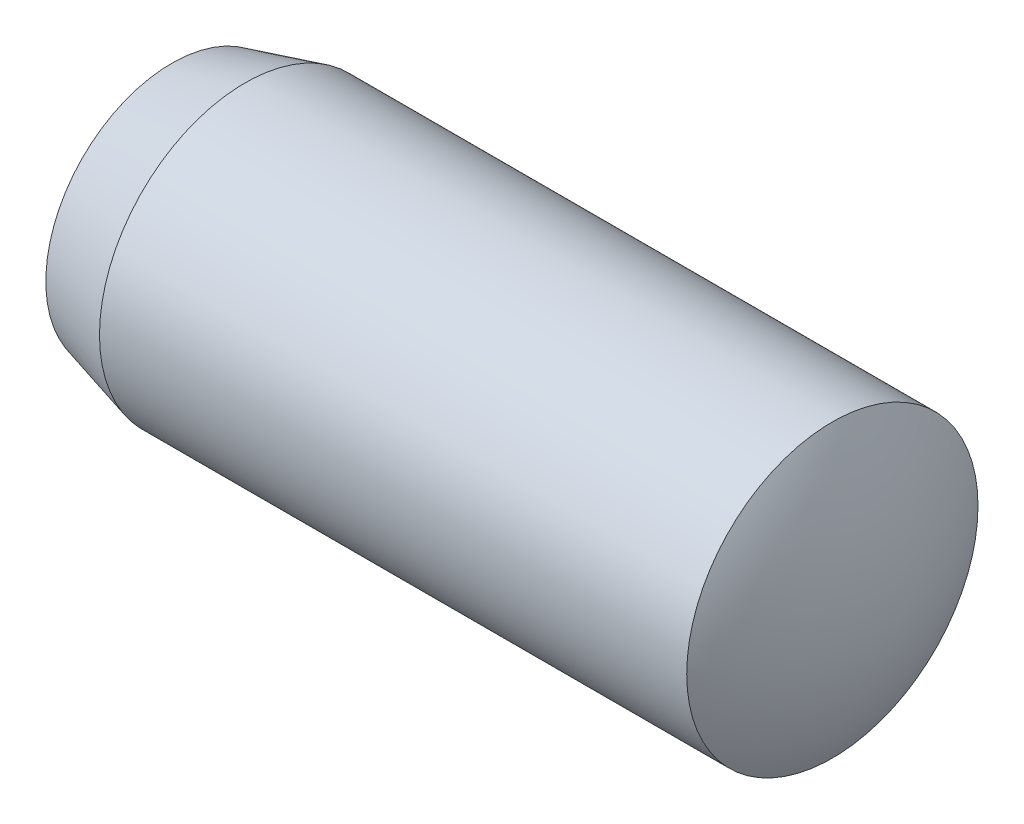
ISO-10303-21;
HEADER;
FILE_DESCRIPTION(('STEP AP214'),'2;1');
FILE_NAME('part.step','',(''),(''),'','','');
FILE_SCHEMA(('AUTOMOTIVE_DESIGN { 1 0 10303 214 1 1 1 1 }'));
ENDSEC;
DATA;
#1=APPLICATION_CONTEXT('core data for automotive mechanical design processes');
#2=APPLICATION_PROTOCOL_DEFINITION('international standard','automotive_design',2000,#1);
#3=PRODUCT_CONTEXT('',#1,'mechanical');
#4=PRODUCT('Part','Part','',(#3));
#5=PRODUCT_RELATED_PRODUCT_CATEGORY('part','',(#4));
#6=PRODUCT_DEFINITION_FORMATION('','',#4);
#7=PRODUCT_DEFINITION_CONTEXT('part definition',#1,'design');
#8=PRODUCT_DEFINITION('design','',#6,#7);
#9=PRODUCT_DEFINITION_SHAPE('','',#8);
#10=(LENGTH_UNIT() NAMED_UNIT(*) SI_UNIT(.MILLI.,.METRE.));
#11=(NAMED_UNIT(*) PLANE_ANGLE_UNIT() SI_UNIT($,.RADIAN.));
#12=(NAMED_UNIT(*) SI_UNIT($,.STERADIAN.) SOLID_ANGLE_UNIT());
#13=UNCERTAINTY_MEASURE_WITH_UNIT(LENGTH_MEASURE(1.E-05),#10,'distance_accuracy_value','');
#14=(GEOMETRIC_REPRESENTATION_CONTEXT(3) GLOBAL_UNCERTAINTY_ASSIGNED_CONTEXT((#13)) GLOBAL_UNIT_ASSIGNED_CONTEXT((#10,
#11,#12)) REPRESENTATION_CONTEXT('',''));
#15=CARTESIAN_POINT('',(0.,0.,0.));
#16=DIRECTION('',(0.,0.,1.));
#17=DIRECTION('',(1.,0.,0.));
#18=AXIS2_PLACEMENT_3D('',#15,#16,#17);
#19=CARTESIAN_POINT('',(4.,0.,0.));
#20=DIRECTION('',(1.,0.,0.));
#21=DIRECTION('',(0.,1.,0.));
#22=AXIS2_PLACEMENT_3D('',#19,#20,#21);
#23=SPHERICAL_SURFACE('',#22,4.);
#24=CARTESIAN_POINT('',(0.,0.,0.));
#25=CARTESIAN_POINT('',(-2.33652445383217E-06,0.,-0.0745599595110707));
#26=CARTESIAN_POINT('',(0.00208460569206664,0.,-0.149119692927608));
#27=CARTESIAN_POINT('',(0.0104202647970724,0.,-0.298006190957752));
#28=CARTESIAN_POINT('',(0.0166689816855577,0.,-0.372332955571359));
#29=CARTESIAN_POINT('',(0.0333114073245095,0.,-0.520520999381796));
#30=CARTESIAN_POINT('',(0.043705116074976,0.,-0.594382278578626));
#31=CARTESIAN_POINT('',(0.0686042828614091,0.,-0.741408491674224));
#32=CARTESIAN_POINT('',(0.0831097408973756,0.,-0.814573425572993));
#33=CARTESIAN_POINT('',(0.116187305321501,0.,-0.9599781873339));
#34=CARTESIAN_POINT('',(0.134759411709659,0.,-1.03221801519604));
#35=CARTESIAN_POINT('',(0.175911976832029,0.,-1.17554680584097));
#36=CARTESIAN_POINT('',(0.19849243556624,0.,-1.24663576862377));
#37=CARTESIAN_POINT('',(0.247591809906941,0.,-1.38744030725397));
#38=CARTESIAN_POINT('',(0.27411072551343,0.,-1.45715588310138));
#39=CARTESIAN_POINT('',(0.331001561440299,0.,-1.59499675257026));
#40=CARTESIAN_POINT('',(0.361373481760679,0.,-1.66312204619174));
#41=CARTESIAN_POINT('',(0.39362917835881,0.,-1.73034375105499));
#42=B_SPLINE_CURVE_WITH_KNOTS('',3,(#24,#25,#26,#27,#28,#29,#30,#31,#32,#33,#34,#35,#36,#37,#38,
#39,#40,#41),.UNSPECIFIED.,.F.,.F.,(4,2,2,2,2,2,2,2,4),(0.,0.223650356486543,0.447300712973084,
0.670951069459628,0.894601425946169,1.11825178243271,1.34190213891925,1.5655524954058,
1.78920285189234),.UNSPECIFIED.);
#43=CARTESIAN_POINT('',(0.,0.,0.));
#44=VERTEX_POINT('',#43);
#45=CARTESIAN_POINT('',(0.393629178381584,0.,-1.73034375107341));
#46=VERTEX_POINT('',#45);
#47=EDGE_CURVE('E41',#44,#46,#42,.T.);
#48=ORIENTED_EDGE('',*,*,#47,.T.);
#49=CARTESIAN_POINT('',(0.393629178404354,0.,0.));
#50=DIRECTION('',(1.,0.,0.));
#51=DIRECTION('',(0.,1.,0.));
#52=AXIS2_PLACEMENT_3D('',#49,#50,#51);
#53=CIRCLE('',#52,1.73034375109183);
#54=EDGE_CURVE('E40',#46,#46,#53,.T.);
#55=ORIENTED_EDGE('',*,*,#54,.F.);
#56=ORIENTED_EDGE('',*,*,#47,.F.);
#57=EDGE_LOOP('',(#48,#55,#56));
#58=FACE_BOUND('',#57,.T.);
#59=ADVANCED_FACE('F14',(#58),#23,.T.);
#60=CARTESIAN_POINT('',(1.40000000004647,0.,0.));
#61=DIRECTION('',(1.,0.,0.));
#62=DIRECTION('',(0.,0.,-1.));
#63=AXIS2_PLACEMENT_3D('',#60,#61,#62);
#64=CONICAL_SURFACE('',#63,2.00000000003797,0.261799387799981);
#65=ORIENTED_EDGE('',*,*,#54,.T.);
#66=EDGE_LOOP('',(#65));
#67=FACE_BOUND('',#66,.T.);
#68=CARTESIAN_POINT('',(1.4,0.,0.));
#69=DIRECTION('',(1.,0.,0.));
#70=DIRECTION('',(0.,0.,-1.));
#71=AXIS2_PLACEMENT_3D('',#68,#69,#70);
#72=CIRCLE('',#71,2.);
#73=CARTESIAN_POINT('',(1.4,0.,-2.));
#74=VERTEX_POINT('',#73);
#75=EDGE_CURVE('E26',#74,#74,#72,.T.);
#76=ORIENTED_EDGE('',*,*,#75,.F.);
#77=EDGE_LOOP('',(#76));
#78=FACE_BOUND('',#77,.T.);
#79=ADVANCED_FACE('F58',(#67,#78),#64,.T.);
#80=CARTESIAN_POINT('',(6.,0.,0.));
#81=DIRECTION('',(1.,0.,0.));
#82=DIRECTION('',(0.,1.,0.));
#83=AXIS2_PLACEMENT_3D('',#80,#81,#82);
#84=SPHERICAL_SURFACE('',#83,4.);
#85=CARTESIAN_POINT('',(10.,0.,0.));
#86=CARTESIAN_POINT('',(10.0000002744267,0.,-0.0436332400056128));
#87=CARTESIAN_POINT('',(9.99928606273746,0.,-0.087266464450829));
#88=CARTESIAN_POINT('',(9.99643063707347,-1.63995471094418E-13,-0.174486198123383));
#89=CARTESIAN_POINT('',(9.99428942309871,-2.04961405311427E-13,-0.21807270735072));
#90=CARTESIAN_POINT('',(9.98858196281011,-2.86805489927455E-13,-0.30515232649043));
#91=CARTESIAN_POINT('',(9.98501571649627,-3.27683640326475E-13,-0.348645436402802));
#92=CARTESIAN_POINT('',(9.97646209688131,-4.09308386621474E-13,-0.43549168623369));
#93=CARTESIAN_POINT('',(9.9714747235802,-4.50054982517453E-13,-0.478844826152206));
#94=CARTESIAN_POINT('',(9.96008416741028,-5.3137298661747E-13,-0.565364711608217));
#95=CARTESIAN_POINT('',(9.95368098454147,-5.71944394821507E-13,-0.608531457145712));
#96=CARTESIAN_POINT('',(9.93946567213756,-6.52868578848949E-13,-0.69463233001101));
#97=CARTESIAN_POINT('',(9.93165354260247,-6.93221354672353E-13,-0.737566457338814));
#98=CARTESIAN_POINT('',(9.91462870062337,-7.73665063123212E-13,-0.823156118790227));
#99=CARTESIAN_POINT('',(9.90541598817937,-8.13755995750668E-13,-0.865811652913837));
#100=CARTESIAN_POINT('',(9.88559984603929,-8.93633087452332E-13,-0.950798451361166));
#101=CARTESIAN_POINT('',(9.87499641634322,-9.3341924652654E-13,-0.993129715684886));
#102=CARTESIAN_POINT('',(9.85241019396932,-1.01264418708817E-12,-1.0774226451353));
#103=CARTESIAN_POINT('',(9.84042740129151,-1.05208296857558E-12,-1.11938431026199));
#104=CARTESIAN_POINT('',(9.81509528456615,-1.13057092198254E-12,-1.20289310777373));
#105=CARTESIAN_POINT('',(9.80174596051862,-1.16962009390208E-12,-1.24444024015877));
#106=CARTESIAN_POINT('',(9.77369507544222,-1.24728701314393E-12,-1.32707548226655));
#107=CARTESIAN_POINT('',(9.75899351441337,-1.28590476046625E-12,-1.36816359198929));
#108=CARTESIAN_POINT('',(9.72825389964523,-1.36266747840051E-12,-1.44983679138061));
#109=CARTESIAN_POINT('',(9.71221584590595,-1.40081244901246E-12,-1.49042188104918));
#110=CARTESIAN_POINT('',(9.67882041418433,-1.47658876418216E-12,-1.57104557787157));
#111=CARTESIAN_POINT('',(9.66146303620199,-1.51422010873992E-12,-1.61108418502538));
#112=CARTESIAN_POINT('',(9.6254475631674,-1.58892888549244E-12,-1.69057205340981));
#113=CARTESIAN_POINT('',(9.60678946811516,-1.62600631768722E-12,-1.73002131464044));
#114=CARTESIAN_POINT('',(9.56819246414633,-1.69956752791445E-12,-1.8082882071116));
#115=CARTESIAN_POINT('',(9.54825355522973,-1.7360513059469E-12,-1.84710583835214));
#116=CARTESIAN_POINT('',(9.50711655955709,-1.80838628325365E-12,-1.92406805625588));
#117=CARTESIAN_POINT('',(9.48591847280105,-1.84423748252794E-12,-1.96221264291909));
#118=CARTESIAN_POINT('',(9.46410161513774,-1.87975293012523E-12,-2.00000000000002));
#119=B_SPLINE_CURVE_WITH_KNOTS('',3,(#85,#86,#87,#88,#89,#90,#91,#92,#93,#94,#95,#96,#97,#98,
#99,#100,#101,#102,#103,#104,#105,#106,#107,#108,#109,#110,#111,#112,#113,#114,#115,#116,#117,
#118),.UNSPECIFIED.,.F.,.F.,(4,2,2,2,2,2,2,2,2,2,2,2,2,2,2,2,4),(0.,0.130893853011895,
0.261787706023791,0.392681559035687,0.523575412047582,0.654469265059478,0.785363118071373,
0.916256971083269,1.04715082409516,1.17804467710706,1.30893853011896,1.43983238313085,
1.57072623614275,1.70162008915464,1.83251394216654,1.96340779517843,2.09430164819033),.UNSPECIFIED.);
#120=CARTESIAN_POINT('',(10.,0.,0.));
#121=VERTEX_POINT('',#120);
#122=CARTESIAN_POINT('',(9.46410161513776,-9.36537214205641E-13,-2.));
#123=VERTEX_POINT('',#122);
#124=EDGE_CURVE('E70',#121,#123,#119,.T.);
#125=ORIENTED_EDGE('',*,*,#124,.T.);
#126=CARTESIAN_POINT('',(9.46410161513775,0.,0.));
#127=DIRECTION('',(1.,0.,0.));
#128=DIRECTION('',(0.,0.,-1.));
#129=AXIS2_PLACEMENT_3D('',#126,#127,#128);
#130=CIRCLE('',#129,2.);
#131=EDGE_CURVE('E9',#123,#123,#130,.F.);
#132=ORIENTED_EDGE('',*,*,#131,.F.);
#133=ORIENTED_EDGE('',*,*,#124,.F.);
#134=EDGE_LOOP('',(#125,#132,#133));
#135=FACE_BOUND('',#134,.T.);
#136=ADVANCED_FACE('F48',(#135),#84,.T.);
#137=CARTESIAN_POINT('',(5.43205080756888,0.,0.));
#138=DIRECTION('',(1.,0.,0.));
#139=DIRECTION('',(0.,0.,-1.));
#140=AXIS2_PLACEMENT_3D('',#137,#138,#139);
#141=CYLINDRICAL_SURFACE('',#140,2.);
#142=ORIENTED_EDGE('',*,*,#75,.T.);
#143=EDGE_LOOP('',(#142));
#144=FACE_BOUND('',#143,.T.);
#145=ORIENTED_EDGE('',*,*,#131,.T.);
#146=EDGE_LOOP('',(#145));
#147=FACE_BOUND('',#146,.T.);
#148=ADVANCED_FACE('F16',(#144,#147),#141,.T.);
#149=CLOSED_SHELL('',(#59,#79,#136,#148));
#150=MANIFOLD_SOLID_BREP('B1',#149);
#151=ADVANCED_BREP_SHAPE_REPRESENTATION('',(#18,#150),#14);
#152=SHAPE_DEFINITION_REPRESENTATION(#9,#151);
ENDSEC;
END-ISO-10303-21;
